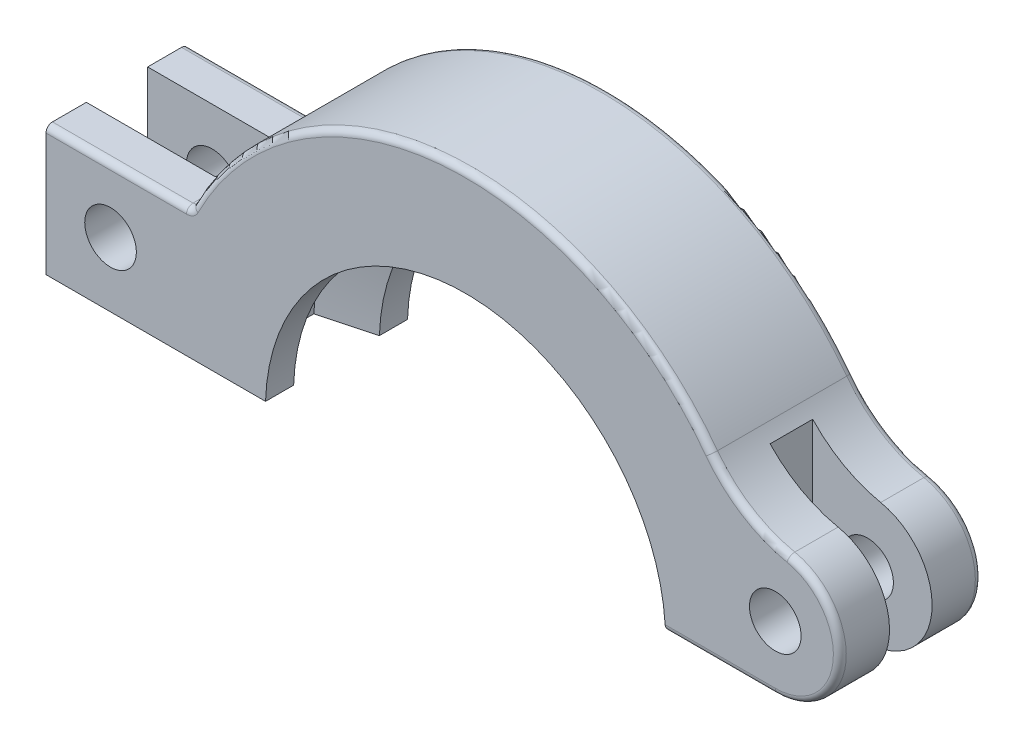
ISO-10303-21;
HEADER;
FILE_DESCRIPTION(('STEP AP214'),'2;1');
FILE_NAME('part.step','',(''),(''),'','','');
FILE_SCHEMA(('AUTOMOTIVE_DESIGN { 1 0 10303 214 1 1 1 1 }'));
ENDSEC;
DATA;
#1=APPLICATION_CONTEXT('core data for automotive mechanical design processes');
#2=APPLICATION_PROTOCOL_DEFINITION('international standard','automotive_design',2000,#1);
#3=PRODUCT_CONTEXT('',#1,'mechanical');
#4=PRODUCT('Part','Part','',(#3));
#5=PRODUCT_RELATED_PRODUCT_CATEGORY('part','',(#4));
#6=PRODUCT_DEFINITION_FORMATION('','',#4);
#7=PRODUCT_DEFINITION_CONTEXT('part definition',#1,'design');
#8=PRODUCT_DEFINITION('design','',#6,#7);
#9=PRODUCT_DEFINITION_SHAPE('','',#8);
#10=(LENGTH_UNIT() NAMED_UNIT(*) SI_UNIT(.MILLI.,.METRE.));
#11=(NAMED_UNIT(*) PLANE_ANGLE_UNIT() SI_UNIT($,.RADIAN.));
#12=(NAMED_UNIT(*) SI_UNIT($,.STERADIAN.) SOLID_ANGLE_UNIT());
#13=UNCERTAINTY_MEASURE_WITH_UNIT(LENGTH_MEASURE(1.E-05),#10,'distance_accuracy_value','');
#14=(GEOMETRIC_REPRESENTATION_CONTEXT(3) GLOBAL_UNCERTAINTY_ASSIGNED_CONTEXT((#13)) GLOBAL_UNIT_ASSIGNED_CONTEXT((#10,
#11,#12)) REPRESENTATION_CONTEXT('',''));
#15=CARTESIAN_POINT('',(0.,0.,0.));
#16=DIRECTION('',(0.,0.,1.));
#17=DIRECTION('',(1.,0.,0.));
#18=AXIS2_PLACEMENT_3D('',#15,#16,#17);
#19=CARTESIAN_POINT('',(30.9838667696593,1.,11.));
#20=DIRECTION('',(0.,1.,0.));
#21=DIRECTION('',(-1.,0.,0.));
#22=AXIS2_PLACEMENT_3D('',#19,#20,#21);
#23=PLANE('',#22);
#24=CARTESIAN_POINT('',(49.0721522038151,1.,1.79844507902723));
#25=CARTESIAN_POINT('',(46.2677102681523,1.,2.54972912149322));
#26=CARTESIAN_POINT('',(43.4632653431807,1.,3.30100201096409));
#27=CARTESIAN_POINT('',(37.854350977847,1.,4.80345618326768));
#28=CARTESIAN_POINT('',(35.0498815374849,1.,5.5546374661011));
#29=CARTESIAN_POINT('',(29.440899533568,1.,7.05683914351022));
#30=CARTESIAN_POINT('',(26.6363869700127,1.,7.80785953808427));
#31=CARTESIAN_POINT('',(22.4295386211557,1.,8.93409324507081));
#32=CARTESIAN_POINT('',(21.0272425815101,0.999999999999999,9.30945500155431));
#33=CARTESIAN_POINT('',(18.2225959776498,0.999999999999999,10.0599747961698));
#34=CARTESIAN_POINT('',(16.8202454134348,0.999999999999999,10.4351328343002));
#35=CARTESIAN_POINT('',(15.4178535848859,0.999999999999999,10.8101366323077));
#36=B_SPLINE_CURVE_WITH_KNOTS('',3,(#24,#25,#26,#27,#28,#29,#30,#31,#32,#33,#34,#35),
.UNSPECIFIED.,.F.,.F.,(4,2,2,2,2,4),(0.,8.70998855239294,17.4199770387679,26.1299656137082,
30.4849599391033,34.8399543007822),.UNSPECIFIED.);
#37=CARTESIAN_POINT('',(38.9871773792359,1.,4.5));
#38=VERTEX_POINT('',#37);
#39=CARTESIAN_POINT('',(30.9838667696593,1.,6.64359353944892));
#40=VERTEX_POINT('',#39);
#41=EDGE_CURVE('E239',#38,#40,#36,.T.);
#42=ORIENTED_EDGE('',*,*,#41,.F.);
#43=DIRECTION('',(0.,0.,1.));
#44=VECTOR('',#43,1.);
#45=CARTESIAN_POINT('',(38.9871773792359,1.,0.));
#46=LINE('',#45,#44);
#47=CARTESIAN_POINT('',(38.9871773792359,1.,-4.5));
#48=VERTEX_POINT('',#47);
#49=EDGE_CURVE('E232',#48,#38,#46,.T.);
#50=ORIENTED_EDGE('',*,*,#49,.F.);
#51=CARTESIAN_POINT('',(14.999598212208,0.999999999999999,-10.921966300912));
#52=CARTESIAN_POINT('',(16.2308050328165,0.999999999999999,-10.5927799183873));
#53=CARTESIAN_POINT('',(17.4619760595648,0.999999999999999,-10.263459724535));
#54=CARTESIAN_POINT('',(19.9242698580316,0.999999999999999,-9.6046390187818));
#55=CARTESIAN_POINT('',(21.1553926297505,1.,-9.27513850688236));
#56=CARTESIAN_POINT('',(24.8487235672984,1.,-8.28649744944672));
#57=CARTESIAN_POINT('',(27.3108943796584,1.,-7.62721737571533));
#58=CARTESIAN_POINT('',(30.4577579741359,1.,-6.78449127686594));
#59=CARTESIAN_POINT('',(31.1424706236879,1.,-6.6011194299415));
#60=CARTESIAN_POINT('',(34.631675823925,1.,-5.66665252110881));
#61=CARTESIAN_POINT('',(37.4361465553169,1.,-4.91547598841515));
#62=CARTESIAN_POINT('',(43.0450626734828,1.,-3.41302835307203));
#63=CARTESIAN_POINT('',(45.8495080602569,1.,-2.66175725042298));
#64=CARTESIAN_POINT('',(48.6539513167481,1.,-1.91047820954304));
#65=B_SPLINE_CURVE_WITH_KNOTS('',3,(#51,#52,#53,#54,#55,#56,#57,#58,#59,#60,#61,#62,#63,#64),
.UNSPECIFIED.,.F.,.F.,(4,2,2,2,2,2,4),(0.,3.82336304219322,7.64672605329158,15.2934520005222,
17.4199772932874,26.1299658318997,34.8399543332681),.UNSPECIFIED.);
#66=CARTESIAN_POINT('',(30.9838667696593,1.,-6.64359353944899));
#67=VERTEX_POINT('',#66);
#68=EDGE_CURVE('E219',#67,#48,#65,.T.);
#69=ORIENTED_EDGE('',*,*,#68,.F.);
#70=DIRECTION('',(0.,0.,-1.));
#71=VECTOR('',#70,1.);
#72=CARTESIAN_POINT('',(30.9838667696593,1.,11.));
#73=LINE('',#72,#71);
#74=CARTESIAN_POINT('',(30.9838667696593,1.,-10.));
#75=VERTEX_POINT('',#74);
#76=EDGE_CURVE('E338',#67,#75,#73,.T.);
#77=ORIENTED_EDGE('',*,*,#76,.T.);
#78=DIRECTION('',(1.,0.,0.));
#79=VECTOR('',#78,1.);
#80=CARTESIAN_POINT('',(30.9838667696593,1.,-10.));
#81=LINE('',#80,#79);
#82=CARTESIAN_POINT('',(48.,1.,-10.));
#83=VERTEX_POINT('',#82);
#84=EDGE_CURVE('E365',#75,#83,#81,.T.);
#85=ORIENTED_EDGE('',*,*,#84,.T.);
#86=DIRECTION('',(0.,0.,-1.));
#87=VECTOR('',#86,1.);
#88=CARTESIAN_POINT('',(48.,1.,11.));
#89=LINE('',#88,#87);
#90=CARTESIAN_POINT('',(48.,0.999999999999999,-3.30000000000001));
#91=VERTEX_POINT('',#90);
#92=EDGE_CURVE('E335',#91,#83,#89,.T.);
#93=ORIENTED_EDGE('',*,*,#92,.F.);
#94=DIRECTION('',(1.,0.,0.));
#95=VECTOR('',#94,1.);
#96=CARTESIAN_POINT('',(30.9838667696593,1.,-3.3));
#97=LINE('',#96,#95);
#98=CARTESIAN_POINT('',(39.5,1.,-3.30000000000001));
#99=VERTEX_POINT('',#98);
#100=EDGE_CURVE('E273',#99,#91,#97,.T.);
#101=ORIENTED_EDGE('',*,*,#100,.F.);
#102=DIRECTION('',(0.,0.,-1.));
#103=VECTOR('',#102,1.);
#104=CARTESIAN_POINT('',(39.5,1.,11.));
#105=LINE('',#104,#103);
#106=CARTESIAN_POINT('',(39.5,1.,3.29999999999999));
#107=VERTEX_POINT('',#106);
#108=EDGE_CURVE('E275',#107,#99,#105,.T.);
#109=ORIENTED_EDGE('',*,*,#108,.F.);
#110=DIRECTION('',(-1.,0.,0.));
#111=VECTOR('',#110,1.);
#112=CARTESIAN_POINT('',(30.9838667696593,1.,3.3));
#113=LINE('',#112,#111);
#114=CARTESIAN_POINT('',(48.,0.999999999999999,3.29999999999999));
#115=VERTEX_POINT('',#114);
#116=EDGE_CURVE('E266',#115,#107,#113,.T.);
#117=ORIENTED_EDGE('',*,*,#116,.F.);
#118=CARTESIAN_POINT('',(48.,1.,10.));
#119=VERTEX_POINT('',#118);
#120=EDGE_CURVE('E336',#119,#115,#89,.T.);
#121=ORIENTED_EDGE('',*,*,#120,.F.);
#122=DIRECTION('',(1.,0.,0.));
#123=VECTOR('',#122,1.);
#124=CARTESIAN_POINT('',(30.9838667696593,1.,10.));
#125=LINE('',#124,#123);
#126=CARTESIAN_POINT('',(30.9838667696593,1.,10.));
#127=VERTEX_POINT('',#126);
#128=EDGE_CURVE('E363',#119,#127,#125,.F.);
#129=ORIENTED_EDGE('',*,*,#128,.T.);
#130=EDGE_CURVE('E339',#127,#40,#73,.T.);
#131=ORIENTED_EDGE('',*,*,#130,.T.);
#132=EDGE_LOOP('',(#42,#50,#69,#77,#85,#93,#101,#109,#117,#121,#129,#131));
#133=FACE_BOUND('',#132,.T.);
#134=ADVANCED_FACE('F34',(#133),#23,.F.);
#135=CARTESIAN_POINT('',(-65.,1.,11.));
#136=DIRECTION('',(0.,1.,0.));
#137=DIRECTION('',(0.,0.,1.));
#138=AXIS2_PLACEMENT_3D('',#135,#136,#137);
#139=PLANE('',#138);
#140=CARTESIAN_POINT('',(-21.027961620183,1.,9.30922550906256));
#141=CARTESIAN_POINT('',(-23.8325618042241,1.,8.55853239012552));
#142=CARTESIAN_POINT('',(-26.6371071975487,1.,7.80763464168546));
#143=CARTESIAN_POINT('',(-32.2461307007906,1.,6.3055879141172));
#144=CARTESIAN_POINT('',(-35.0506088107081,1.,5.55443893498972));
#145=CARTESIAN_POINT('',(-40.6595400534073,1.,4.05204777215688));
#146=CARTESIAN_POINT('',(-43.4639931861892,1.,3.30080558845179));
#147=CARTESIAN_POINT('',(-49.0728829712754,1.,1.79825967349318));
#148=CARTESIAN_POINT('',(-51.8773196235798,1.,1.04695594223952));
#149=CARTESIAN_POINT('',(-54.6817522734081,1.,0.29563726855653));
#150=B_SPLINE_CURVE_WITH_KNOTS('',3,(#140,#141,#142,#143,#144,#145,#146,#147,#148,#149),
.UNSPECIFIED.,.F.,.F.,(4,2,2,2,4),(0.,8.70998855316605,17.4199770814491,26.1299655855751,
34.839954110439),.UNSPECIFIED.);
#151=CARTESIAN_POINT('',(-30.9838667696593,1.,6.64359353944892));
#152=VERTEX_POINT('',#151);
#153=CARTESIAN_POINT('',(-38.9871773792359,1.,4.5));
#154=VERTEX_POINT('',#153);
#155=EDGE_CURVE('E227',#152,#154,#150,.T.);
#156=ORIENTED_EDGE('',*,*,#155,.F.);
#157=DIRECTION('',(0.,0.,-1.));
#158=VECTOR('',#157,1.);
#159=CARTESIAN_POINT('',(-30.9838667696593,1.,11.));
#160=LINE('',#159,#158);
#161=CARTESIAN_POINT('',(-30.9838667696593,1.,11.));
#162=VERTEX_POINT('',#161);
#163=EDGE_CURVE('E342',#162,#152,#160,.T.);
#164=ORIENTED_EDGE('',*,*,#163,.F.);
#165=DIRECTION('',(1.,0.,0.));
#166=VECTOR('',#165,1.);
#167=CARTESIAN_POINT('',(-65.,1.,11.));
#168=LINE('',#167,#166);
#169=CARTESIAN_POINT('',(-65.,1.,11.));
#170=VERTEX_POINT('',#169);
#171=EDGE_CURVE('E315',#170,#162,#168,.T.);
#172=ORIENTED_EDGE('',*,*,#171,.F.);
#173=DIRECTION('',(0.,0.,-1.));
#174=VECTOR('',#173,1.);
#175=CARTESIAN_POINT('',(-65.,1.,11.));
#176=LINE('',#175,#174);
#177=CARTESIAN_POINT('',(-65.,1.,4.75));
#178=VERTEX_POINT('',#177);
#179=EDGE_CURVE('E346',#170,#178,#176,.T.);
#180=ORIENTED_EDGE('',*,*,#179,.T.);
#181=DIRECTION('',(-1.,0.,0.));
#182=VECTOR('',#181,1.);
#183=CARTESIAN_POINT('',(-65.,1.,4.75));
#184=LINE('',#183,#182);
#185=CARTESIAN_POINT('',(-45.,1.,4.75));
#186=VERTEX_POINT('',#185);
#187=EDGE_CURVE('E296',#186,#178,#184,.T.);
#188=ORIENTED_EDGE('',*,*,#187,.F.);
#189=DIRECTION('',(0.,0.,1.));
#190=VECTOR('',#189,1.);
#191=CARTESIAN_POINT('',(-45.,1.,11.));
#192=LINE('',#191,#190);
#193=CARTESIAN_POINT('',(-45.,1.,-4.75));
#194=VERTEX_POINT('',#193);
#195=EDGE_CURVE('E298',#194,#186,#192,.T.);
#196=ORIENTED_EDGE('',*,*,#195,.F.);
#197=DIRECTION('',(1.,0.,0.));
#198=VECTOR('',#197,1.);
#199=CARTESIAN_POINT('',(-65.,1.,-4.75));
#200=LINE('',#199,#198);
#201=CARTESIAN_POINT('',(-65.,1.,-4.75));
#202=VERTEX_POINT('',#201);
#203=EDGE_CURVE('E288',#202,#194,#200,.T.);
#204=ORIENTED_EDGE('',*,*,#203,.F.);
#205=CARTESIAN_POINT('',(-65.,1.,-11.));
#206=VERTEX_POINT('',#205);
#207=EDGE_CURVE('E345',#202,#206,#176,.T.);
#208=ORIENTED_EDGE('',*,*,#207,.T.);
#209=DIRECTION('',(1.,0.,0.));
#210=VECTOR('',#209,1.);
#211=CARTESIAN_POINT('',(-65.,1.,-11.));
#212=LINE('',#211,#210);
#213=CARTESIAN_POINT('',(-30.9838667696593,1.,-11.));
#214=VERTEX_POINT('',#213);
#215=EDGE_CURVE('E323',#206,#214,#212,.T.);
#216=ORIENTED_EDGE('',*,*,#215,.T.);
#217=CARTESIAN_POINT('',(-30.9838667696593,1.,-6.64359353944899));
#218=VERTEX_POINT('',#217);
#219=EDGE_CURVE('E341',#218,#214,#160,.T.);
#220=ORIENTED_EDGE('',*,*,#219,.F.);
#221=CARTESIAN_POINT('',(-54.6817522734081,1.,-0.295637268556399));
#222=CARTESIAN_POINT('',(-51.8773196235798,1.,-1.04695594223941));
#223=CARTESIAN_POINT('',(-49.0728829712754,1.,-1.7982596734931));
#224=CARTESIAN_POINT('',(-43.4639931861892,1.,-3.30080558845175));
#225=CARTESIAN_POINT('',(-40.6595400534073,1.,-4.05204777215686));
#226=CARTESIAN_POINT('',(-35.0506088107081,1.,-5.55443893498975));
#227=CARTESIAN_POINT('',(-32.2461307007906,1.,-6.30558791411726));
#228=CARTESIAN_POINT('',(-26.6371071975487,1.,-7.80763464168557));
#229=CARTESIAN_POINT('',(-23.8325618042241,1.,-8.55853239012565));
#230=CARTESIAN_POINT('',(-21.027961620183,1.,-9.30922550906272));
#231=B_SPLINE_CURVE_WITH_KNOTS('',3,(#221,#222,#223,#224,#225,#226,#227,#228,#229,#230),
.UNSPECIFIED.,.F.,.F.,(4,2,2,2,4),(0.,8.70998852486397,17.41997702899,26.129965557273,
34.8399541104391),.UNSPECIFIED.);
#232=CARTESIAN_POINT('',(-38.9871773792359,1.,-4.5));
#233=VERTEX_POINT('',#232);
#234=EDGE_CURVE('E50',#233,#218,#231,.T.);
#235=ORIENTED_EDGE('',*,*,#234,.F.);
#236=DIRECTION('',(0.,0.,1.));
#237=VECTOR('',#236,1.);
#238=CARTESIAN_POINT('',(-38.9871773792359,1.,0.));
#239=LINE('',#238,#237);
#240=EDGE_CURVE('E11',#154,#233,#239,.F.);
#241=ORIENTED_EDGE('',*,*,#240,.F.);
#242=EDGE_LOOP('',(#156,#164,#172,#180,#188,#196,#204,#208,#216,#220,#235,#241));
#243=FACE_BOUND('',#242,.T.);
#244=ADVANCED_FACE('F398',(#243),#139,.F.);
#245=CARTESIAN_POINT('',(0.,0.,11.));
#246=DIRECTION('',(0.,0.,-1.));
#247=DIRECTION('',(-1.,0.,0.));
#248=AXIS2_PLACEMENT_3D('',#245,#246,#247);
#249=CYLINDRICAL_SURFACE('',#248,31.);
#250=CARTESIAN_POINT('',(0.,0.,6.64359353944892));
#251=DIRECTION('',(0.,0.,-1.));
#252=DIRECTION('',(-1.,0.,0.));
#253=AXIS2_PLACEMENT_3D('',#250,#251,#252);
#254=CIRCLE('',#253,31.);
#255=EDGE_CURVE('E43',#40,#152,#254,.F.);
#256=ORIENTED_EDGE('',*,*,#255,.F.);
#257=ORIENTED_EDGE('',*,*,#130,.F.);
#258=CARTESIAN_POINT('',(30.9838667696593,1.,10.));
#259=CARTESIAN_POINT('',(30.9838665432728,1.00000018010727,10.0281206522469));
#260=CARTESIAN_POINT('',(30.9838284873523,1.00118690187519,10.0562278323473));
#261=CARTESIAN_POINT('',(30.9836752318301,1.00592117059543,10.1122410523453));
#262=CARTESIAN_POINT('',(30.983560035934,1.00946860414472,10.1401471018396));
#263=CARTESIAN_POINT('',(30.9830970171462,1.02361814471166,10.2232146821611));
#264=CARTESIAN_POINT('',(30.9826317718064,1.03772758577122,10.2778197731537));
#265=CARTESIAN_POINT('',(30.9813640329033,1.07490676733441,10.3838832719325));
#266=CARTESIAN_POINT('',(30.9805613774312,1.09798080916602,10.43534015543));
#267=CARTESIAN_POINT('',(30.9785836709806,1.15242913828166,10.5336462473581));
#268=CARTESIAN_POINT('',(30.9774086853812,1.18380196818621,10.5804962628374));
#269=CARTESIAN_POINT('',(30.9746480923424,1.2539554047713,10.6682623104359));
#270=CARTESIAN_POINT('',(30.9730624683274,1.29273631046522,10.7091781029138));
#271=CARTESIAN_POINT('',(30.9694479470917,1.37660882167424,10.7839252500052));
#272=CARTESIAN_POINT('',(30.9674189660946,1.4217016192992,10.8177552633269));
#273=CARTESIAN_POINT('',(30.9629003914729,1.51692803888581,10.8773827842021));
#274=CARTESIAN_POINT('',(30.9604105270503,1.56706461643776,10.9031755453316));
#275=CARTESIAN_POINT('',(30.9549788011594,1.67092308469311,10.9459694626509));
#276=CARTESIAN_POINT('',(30.9520371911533,1.72464297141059,10.962975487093));
#277=CARTESIAN_POINT('',(30.9468095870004,1.81557006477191,10.9835479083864));
#278=CARTESIAN_POINT('',(30.9446383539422,1.85221695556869,10.9897144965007));
#279=CARTESIAN_POINT('',(30.9401399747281,1.92590574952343,10.9979400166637));
#280=CARTESIAN_POINT('',(30.9378130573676,1.96294700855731,11.000004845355));
#281=CARTESIAN_POINT('',(30.935416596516,2.,11.));
#282=B_SPLINE_CURVE_WITH_KNOTS('',3,(#258,#259,#260,#261,#262,#263,#264,#265,#266,#267,#268,
#269,#270,#271,#272,#273,#274,#275,#276,#277,#278,#279,#280,#281),.UNSPECIFIED.,.F.,.F.,(4,2,2,
2,2,2,2,2,2,2,2,4),(0.,0.0843101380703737,0.168616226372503,0.336949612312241,0.505363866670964,
0.673748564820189,0.842140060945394,1.0105634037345,1.17908602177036,1.3475151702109,
1.45897763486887,1.57027974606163),.UNSPECIFIED.);
#283=CARTESIAN_POINT('',(30.935416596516,2.,11.));
#284=VERTEX_POINT('',#283);
#285=EDGE_CURVE('E381',#127,#284,#282,.T.);
#286=ORIENTED_EDGE('',*,*,#285,.T.);
#287=CARTESIAN_POINT('',(0.,0.,11.));
#288=DIRECTION('',(0.,0.,-1.));
#289=DIRECTION('',(1.,0.,0.));
#290=AXIS2_PLACEMENT_3D('',#287,#288,#289);
#291=CIRCLE('',#290,31.);
#292=EDGE_CURVE('E318',#162,#284,#291,.T.);
#293=ORIENTED_EDGE('',*,*,#292,.F.);
#294=ORIENTED_EDGE('',*,*,#163,.T.);
#295=EDGE_LOOP('',(#256,#257,#286,#293,#294));
#296=FACE_BOUND('',#295,.T.);
#297=ADVANCED_FACE('F393',(#296),#249,.F.);
#298=CARTESIAN_POINT('',(0.,0.,-6.64359353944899));
#299=DIRECTION('',(0.,0.,1.));
#300=DIRECTION('',(1.,0.,0.));
#301=AXIS2_PLACEMENT_3D('',#298,#299,#300);
#302=CIRCLE('',#301,31.);
#303=EDGE_CURVE('E223',#218,#67,#302,.F.);
#304=ORIENTED_EDGE('',*,*,#303,.F.);
#305=ORIENTED_EDGE('',*,*,#219,.T.);
#306=CARTESIAN_POINT('',(0.,0.,-11.));
#307=DIRECTION('',(0.,0.,-1.));
#308=DIRECTION('',(1.,0.,0.));
#309=AXIS2_PLACEMENT_3D('',#306,#307,#308);
#310=CIRCLE('',#309,31.);
#311=CARTESIAN_POINT('',(30.935416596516,2.,-11.));
#312=VERTEX_POINT('',#311);
#313=EDGE_CURVE('E316',#214,#312,#310,.T.);
#314=ORIENTED_EDGE('',*,*,#313,.T.);
#315=CARTESIAN_POINT('',(30.935416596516,2.,-11.));
#316=CARTESIAN_POINT('',(30.9372355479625,1.97186831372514,-10.9999997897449));
#317=CARTESIAN_POINT('',(30.9390147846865,1.94374748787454,-10.9988121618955));
#318=CARTESIAN_POINT('',(30.942484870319,1.88770138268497,-10.9940728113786));
#319=CARTESIAN_POINT('',(30.9441757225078,1.85977609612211,-10.9905211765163));
#320=CARTESIAN_POINT('',(30.9490972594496,1.77663904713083,-10.9763512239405));
#321=CARTESIAN_POINT('',(30.9521827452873,1.7219758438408,-10.9622177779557));
#322=CARTESIAN_POINT('',(30.9579084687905,1.61577877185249,-10.9249576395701));
#323=CARTESIAN_POINT('',(30.9605484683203,1.5642465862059,-10.9018261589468));
#324=CARTESIAN_POINT('',(30.9653659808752,1.46578965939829,-10.8472222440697));
#325=CARTESIAN_POINT('',(30.9675435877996,1.41886398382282,-10.8157515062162));
#326=CARTESIAN_POINT('',(30.971443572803,1.33102137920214,-10.7454062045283));
#327=CARTESIAN_POINT('',(30.9731665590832,1.29009645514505,-10.7065416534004));
#328=CARTESIAN_POINT('',(30.9761900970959,1.21533961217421,-10.6224725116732));
#329=CARTESIAN_POINT('',(30.9774905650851,1.18150909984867,-10.5772666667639));
#330=CARTESIAN_POINT('',(30.9797051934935,1.12194346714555,-10.4818493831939));
#331=CARTESIAN_POINT('',(30.9806196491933,1.09620216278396,-10.4316418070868));
#332=CARTESIAN_POINT('',(30.9821004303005,1.05352349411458,-10.3276241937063));
#333=CARTESIAN_POINT('',(30.982666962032,1.03658091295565,-10.2738163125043));
#334=CARTESIAN_POINT('',(30.9833404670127,1.01620782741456,-10.1830639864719));
#335=CARTESIAN_POINT('',(30.9835385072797,1.01013355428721,-10.146691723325));
#336=CARTESIAN_POINT('',(30.9838012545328,1.00203019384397,-10.0735514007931));
#337=CARTESIAN_POINT('',(30.983866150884,0.999995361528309,-10.0367839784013));
#338=CARTESIAN_POINT('',(30.9838667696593,1.,-10.));
#339=B_SPLINE_CURVE_WITH_KNOTS('',3,(#315,#316,#317,#318,#319,#320,#321,#322,#323,#324,#325,
#326,#327,#328,#329,#330,#331,#332,#333,#334,#335,#336,#337,#338),.UNSPECIFIED.,.F.,.F.,(4,2,2,
2,2,2,2,2,2,2,2,4),(0.,0.0845195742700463,0.16903600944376,0.337801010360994,0.506655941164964,
0.675476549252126,0.844070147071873,1.01269713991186,1.18119490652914,1.34959265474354,
1.46001320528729,1.5702765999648),.UNSPECIFIED.);
#340=EDGE_CURVE('E387',#312,#75,#339,.T.);
#341=ORIENTED_EDGE('',*,*,#340,.T.);
#342=ORIENTED_EDGE('',*,*,#76,.F.);
#343=EDGE_LOOP('',(#304,#305,#314,#341,#342));
#344=FACE_BOUND('',#343,.T.);
#345=ADVANCED_FACE('F397',(#344),#249,.F.);
#346=CARTESIAN_POINT('',(48.,11.,11.));
#347=DIRECTION('',(0.,0.,-1.));
#348=DIRECTION('',(-1.,0.,0.));
#349=AXIS2_PLACEMENT_3D('',#346,#347,#348);
#350=CYLINDRICAL_SURFACE('',#349,10.);
#351=ORIENTED_EDGE('',*,*,#92,.T.);
#352=CARTESIAN_POINT('',(48.,11.,-10.));
#353=DIRECTION('',(0.,0.,1.));
#354=DIRECTION('',(1.,0.,0.));
#355=AXIS2_PLACEMENT_3D('',#352,#353,#354);
#356=CIRCLE('',#355,10.);
#357=CARTESIAN_POINT('',(50.0312833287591,20.7915212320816,-10.));
#358=VERTEX_POINT('',#357);
#359=EDGE_CURVE('E804',#83,#358,#356,.T.);
#360=ORIENTED_EDGE('',*,*,#359,.T.);
#361=DIRECTION('',(0.,0.,-1.));
#362=VECTOR('',#361,1.);
#363=CARTESIAN_POINT('',(50.0312833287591,20.7915212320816,11.));
#364=LINE('',#363,#362);
#365=CARTESIAN_POINT('',(50.0312833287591,20.7915212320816,-3.30000000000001));
#366=VERTEX_POINT('',#365);
#367=EDGE_CURVE('E332',#366,#358,#364,.T.);
#368=ORIENTED_EDGE('',*,*,#367,.F.);
#369=CARTESIAN_POINT('',(48.,11.,-3.30000000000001));
#370=DIRECTION('',(0.,0.,1.));
#371=DIRECTION('',(1.,0.,0.));
#372=AXIS2_PLACEMENT_3D('',#369,#370,#371);
#373=CIRCLE('',#372,10.);
#374=EDGE_CURVE('E271',#91,#366,#373,.T.);
#375=ORIENTED_EDGE('',*,*,#374,.F.);
#376=EDGE_LOOP('',(#351,#360,#368,#375));
#377=FACE_BOUND('',#376,.T.);
#378=ADVANCED_FACE('F482',(#377),#350,.T.);
#379=CARTESIAN_POINT('',(50.0312833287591,20.7915212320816,10.));
#380=VERTEX_POINT('',#379);
#381=CARTESIAN_POINT('',(50.0312833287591,20.7915212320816,3.29999999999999));
#382=VERTEX_POINT('',#381);
#383=EDGE_CURVE('E333',#380,#382,#364,.T.);
#384=ORIENTED_EDGE('',*,*,#383,.F.);
#385=CARTESIAN_POINT('',(48.,11.,10.));
#386=DIRECTION('',(0.,0.,1.));
#387=DIRECTION('',(1.,0.,0.));
#388=AXIS2_PLACEMENT_3D('',#385,#386,#387);
#389=CIRCLE('',#388,10.);
#390=EDGE_CURVE('E863',#380,#119,#389,.F.);
#391=ORIENTED_EDGE('',*,*,#390,.T.);
#392=ORIENTED_EDGE('',*,*,#120,.T.);
#393=CARTESIAN_POINT('',(48.,11.,3.29999999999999));
#394=DIRECTION('',(0.,0.,-1.));
#395=DIRECTION('',(-1.,0.,0.));
#396=AXIS2_PLACEMENT_3D('',#393,#394,#395);
#397=CIRCLE('',#396,10.);
#398=EDGE_CURVE('E263',#382,#115,#397,.T.);
#399=ORIENTED_EDGE('',*,*,#398,.F.);
#400=EDGE_LOOP('',(#384,#391,#392,#399));
#401=FACE_BOUND('',#400,.T.);
#402=ADVANCED_FACE('F480',(#401),#350,.T.);
#403=CARTESIAN_POINT('',(54.0938499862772,40.3745636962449,11.));
#404=DIRECTION('',(0.,0.,-1.));
#405=DIRECTION('',(-1.,0.,0.));
#406=AXIS2_PLACEMENT_3D('',#403,#404,#405);
#407=CYLINDRICAL_SURFACE('',#406,20.);
#408=ORIENTED_EDGE('',*,*,#367,.T.);
#409=CARTESIAN_POINT('',(54.0938499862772,40.3745636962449,-10.));
#410=DIRECTION('',(0.,0.,1.));
#411=DIRECTION('',(1.,0.,0.));
#412=AXIS2_PLACEMENT_3D('',#409,#410,#411);
#413=CIRCLE('',#412,20.);
#414=CARTESIAN_POINT('',(38.0660425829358,28.4117300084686,-10.));
#415=VERTEX_POINT('',#414);
#416=EDGE_CURVE('E807',#358,#415,#413,.F.);
#417=ORIENTED_EDGE('',*,*,#416,.T.);
#418=DIRECTION('',(0.,0.,-1.));
#419=VECTOR('',#418,1.);
#420=CARTESIAN_POINT('',(38.0660425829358,28.4117300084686,11.));
#421=LINE('',#420,#419);
#422=CARTESIAN_POINT('',(38.0660425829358,28.4117300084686,10.));
#423=VERTEX_POINT('',#422);
#424=EDGE_CURVE('E330',#423,#415,#421,.T.);
#425=ORIENTED_EDGE('',*,*,#424,.F.);
#426=CARTESIAN_POINT('',(54.0938499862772,40.3745636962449,10.));
#427=DIRECTION('',(0.,0.,1.));
#428=DIRECTION('',(1.,0.,0.));
#429=AXIS2_PLACEMENT_3D('',#426,#427,#428);
#430=CIRCLE('',#429,20.);
#431=EDGE_CURVE('E816',#423,#380,#430,.T.);
#432=ORIENTED_EDGE('',*,*,#431,.T.);
#433=ORIENTED_EDGE('',*,*,#383,.T.);
#434=CARTESIAN_POINT('',(54.0938499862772,40.3745636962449,3.29999999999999));
#435=DIRECTION('',(0.,0.,-1.));
#436=DIRECTION('',(-1.,0.,0.));
#437=AXIS2_PLACEMENT_3D('',#434,#435,#436);
#438=CIRCLE('',#437,20.);
#439=CARTESIAN_POINT('',(39.5,26.6990548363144,3.29999999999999));
#440=VERTEX_POINT('',#439);
#441=EDGE_CURVE('E260',#440,#382,#438,.F.);
#442=ORIENTED_EDGE('',*,*,#441,.F.);
#443=DIRECTION('',(0.,0.,-1.));
#444=VECTOR('',#443,1.);
#445=CARTESIAN_POINT('',(39.5,26.6990548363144,11.));
#446=LINE('',#445,#444);
#447=CARTESIAN_POINT('',(39.5,26.6990548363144,-3.30000000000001));
#448=VERTEX_POINT('',#447);
#449=EDGE_CURVE('E356',#448,#440,#446,.F.);
#450=ORIENTED_EDGE('',*,*,#449,.F.);
#451=CARTESIAN_POINT('',(54.0938499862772,40.3745636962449,-3.30000000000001));
#452=DIRECTION('',(0.,0.,1.));
#453=DIRECTION('',(1.,0.,0.));
#454=AXIS2_PLACEMENT_3D('',#451,#452,#453);
#455=CIRCLE('',#454,20.);
#456=EDGE_CURVE('E269',#366,#448,#455,.F.);
#457=ORIENTED_EDGE('',*,*,#456,.F.);
#458=EDGE_LOOP('',(#408,#417,#425,#432,#433,#442,#450,#457));
#459=FACE_BOUND('',#458,.T.);
#460=ADVANCED_FACE('F457',(#459),#407,.F.);
#461=CARTESIAN_POINT('',(48.,11.,11.));
#462=DIRECTION('',(0.,0.,-1.));
#463=DIRECTION('',(-1.,0.,0.));
#464=AXIS2_PLACEMENT_3D('',#461,#462,#463);
#465=CYLINDRICAL_SURFACE('',#464,4.00000000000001);
#466=CARTESIAN_POINT('',(48.,11.,-11.));
#467=DIRECTION('',(0.,0.,1.));
#468=DIRECTION('',(1.,0.,0.));
#469=AXIS2_PLACEMENT_3D('',#466,#467,#468);
#470=CIRCLE('',#469,4.00000000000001);
#471=CARTESIAN_POINT('',(52.,11.,-11.));
#472=VERTEX_POINT('',#471);
#473=EDGE_CURVE('E300',#472,#472,#470,.T.);
#474=ORIENTED_EDGE('',*,*,#473,.F.);
#475=EDGE_LOOP('',(#474));
#476=FACE_BOUND('',#475,.T.);
#477=CARTESIAN_POINT('',(48.,11.,-3.30000000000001));
#478=DIRECTION('',(0.,0.,1.));
#479=DIRECTION('',(1.,0.,0.));
#480=AXIS2_PLACEMENT_3D('',#477,#478,#479);
#481=CIRCLE('',#480,4.00000000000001);
#482=CARTESIAN_POINT('',(52.,11.,-3.30000000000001));
#483=VERTEX_POINT('',#482);
#484=EDGE_CURVE('E268',#483,#483,#481,.T.);
#485=ORIENTED_EDGE('',*,*,#484,.T.);
#486=EDGE_LOOP('',(#485));
#487=FACE_BOUND('',#486,.T.);
#488=ADVANCED_FACE('F453',(#476,#487),#465,.F.);
#489=CARTESIAN_POINT('',(48.,11.,11.));
#490=DIRECTION('',(0.,0.,1.));
#491=DIRECTION('',(1.,0.,0.));
#492=AXIS2_PLACEMENT_3D('',#489,#490,#491);
#493=CIRCLE('',#492,4.00000000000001);
#494=CARTESIAN_POINT('',(52.,11.,11.));
#495=VERTEX_POINT('',#494);
#496=EDGE_CURVE('E301',#495,#495,#493,.T.);
#497=ORIENTED_EDGE('',*,*,#496,.T.);
#498=EDGE_LOOP('',(#497));
#499=FACE_BOUND('',#498,.T.);
#500=CARTESIAN_POINT('',(48.,11.,3.29999999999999));
#501=DIRECTION('',(0.,0.,-1.));
#502=DIRECTION('',(-1.,0.,0.));
#503=AXIS2_PLACEMENT_3D('',#500,#501,#502);
#504=CIRCLE('',#503,4.00000000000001);
#505=CARTESIAN_POINT('',(44.,11.,3.29999999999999));
#506=VERTEX_POINT('',#505);
#507=EDGE_CURVE('E259',#506,#506,#504,.T.);
#508=ORIENTED_EDGE('',*,*,#507,.T.);
#509=EDGE_LOOP('',(#508));
#510=FACE_BOUND('',#509,.T.);
#511=ADVANCED_FACE('F456',(#499,#510),#465,.F.);
#512=CARTESIAN_POINT('',(-65.,1.,11.));
#513=DIRECTION('',(1.,0.,0.));
#514=DIRECTION('',(0.,0.,-1.));
#515=AXIS2_PLACEMENT_3D('',#512,#513,#514);
#516=PLANE('',#515);
#517=DIRECTION('',(0.,-1.,0.));
#518=VECTOR('',#517,1.);
#519=CARTESIAN_POINT('',(-65.,1.,11.));
#520=LINE('',#519,#518);
#521=CARTESIAN_POINT('',(-65.,20.,11.));
#522=VERTEX_POINT('',#521);
#523=EDGE_CURVE('E313',#522,#170,#520,.T.);
#524=ORIENTED_EDGE('',*,*,#523,.F.);
#525=CARTESIAN_POINT('',(-65.,20.,10.));
#526=DIRECTION('',(1.,0.,0.));
#527=DIRECTION('',(0.,0.,-1.));
#528=AXIS2_PLACEMENT_3D('',#525,#526,#527);
#529=CIRCLE('',#528,1.);
#530=CARTESIAN_POINT('',(-65.,21.,10.));
#531=VERTEX_POINT('',#530);
#532=EDGE_CURVE('E849',#522,#531,#529,.F.);
#533=ORIENTED_EDGE('',*,*,#532,.T.);
#534=DIRECTION('',(0.,0.,-1.));
#535=VECTOR('',#534,1.);
#536=CARTESIAN_POINT('',(-65.,21.,11.));
#537=LINE('',#536,#535);
#538=CARTESIAN_POINT('',(-65.,21.,4.75));
#539=VERTEX_POINT('',#538);
#540=EDGE_CURVE('E328',#531,#539,#537,.T.);
#541=ORIENTED_EDGE('',*,*,#540,.T.);
#542=DIRECTION('',(0.,1.,0.));
#543=VECTOR('',#542,1.);
#544=CARTESIAN_POINT('',(-65.,1.,4.75));
#545=LINE('',#544,#543);
#546=EDGE_CURVE('E293',#178,#539,#545,.T.);
#547=ORIENTED_EDGE('',*,*,#546,.F.);
#548=ORIENTED_EDGE('',*,*,#179,.F.);
#549=EDGE_LOOP('',(#524,#533,#541,#547,#548));
#550=FACE_BOUND('',#549,.T.);
#551=ADVANCED_FACE('F407',(#550),#516,.F.);
#552=CARTESIAN_POINT('',(-65.,21.,-4.75));
#553=VERTEX_POINT('',#552);
#554=CARTESIAN_POINT('',(-65.,21.,-10.));
#555=VERTEX_POINT('',#554);
#556=EDGE_CURVE('E321',#553,#555,#537,.T.);
#557=ORIENTED_EDGE('',*,*,#556,.T.);
#558=CARTESIAN_POINT('',(-65.,20.,-10.));
#559=DIRECTION('',(1.,0.,0.));
#560=DIRECTION('',(0.,0.,-1.));
#561=AXIS2_PLACEMENT_3D('',#558,#559,#560);
#562=CIRCLE('',#561,1.);
#563=CARTESIAN_POINT('',(-65.,20.,-11.));
#564=VERTEX_POINT('',#563);
#565=EDGE_CURVE('E877',#555,#564,#562,.F.);
#566=ORIENTED_EDGE('',*,*,#565,.T.);
#567=DIRECTION('',(0.,-1.,0.));
#568=VECTOR('',#567,1.);
#569=CARTESIAN_POINT('',(-65.,1.,-11.));
#570=LINE('',#569,#568);
#571=EDGE_CURVE('E310',#564,#206,#570,.T.);
#572=ORIENTED_EDGE('',*,*,#571,.T.);
#573=ORIENTED_EDGE('',*,*,#207,.F.);
#574=DIRECTION('',(0.,-1.,0.));
#575=VECTOR('',#574,1.);
#576=CARTESIAN_POINT('',(-65.,1.,-4.75));
#577=LINE('',#576,#575);
#578=EDGE_CURVE('E286',#553,#202,#577,.T.);
#579=ORIENTED_EDGE('',*,*,#578,.F.);
#580=EDGE_LOOP('',(#557,#566,#572,#573,#579));
#581=FACE_BOUND('',#580,.T.);
#582=ADVANCED_FACE('F475',(#581),#516,.F.);
#583=CARTESIAN_POINT('',(-65.,21.,11.));
#584=DIRECTION('',(0.,-1.,0.));
#585=DIRECTION('',(1.,0.,0.));
#586=AXIS2_PLACEMENT_3D('',#583,#584,#585);
#587=PLANE('',#586);
#588=DIRECTION('',(0.,0.,1.));
#589=VECTOR('',#588,1.);
#590=CARTESIAN_POINT('',(-43.2232576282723,21.,-11.));
#591=LINE('',#590,#589);
#592=CARTESIAN_POINT('',(-43.2232576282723,21.,10.));
#593=VERTEX_POINT('',#592);
#594=CARTESIAN_POINT('',(-43.2232576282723,21.,-10.));
#595=VERTEX_POINT('',#594);
#596=EDGE_CURVE('E873',#593,#595,#591,.F.);
#597=ORIENTED_EDGE('',*,*,#596,.T.);
#598=DIRECTION('',(-1.,0.,0.));
#599=VECTOR('',#598,1.);
#600=CARTESIAN_POINT('',(-65.,21.,-10.));
#601=LINE('',#600,#599);
#602=EDGE_CURVE('E875',#595,#555,#601,.T.);
#603=ORIENTED_EDGE('',*,*,#602,.T.);
#604=ORIENTED_EDGE('',*,*,#556,.F.);
#605=DIRECTION('',(-1.,0.,0.));
#606=VECTOR('',#605,1.);
#607=CARTESIAN_POINT('',(-65.,21.,-4.75));
#608=LINE('',#607,#606);
#609=CARTESIAN_POINT('',(-45.,21.,-4.75));
#610=VERTEX_POINT('',#609);
#611=EDGE_CURVE('E284',#610,#553,#608,.T.);
#612=ORIENTED_EDGE('',*,*,#611,.F.);
#613=DIRECTION('',(0.,0.,-1.));
#614=VECTOR('',#613,1.);
#615=CARTESIAN_POINT('',(-45.,21.,11.));
#616=LINE('',#615,#614);
#617=CARTESIAN_POINT('',(-45.,21.,4.75));
#618=VERTEX_POINT('',#617);
#619=EDGE_CURVE('E349',#618,#610,#616,.T.);
#620=ORIENTED_EDGE('',*,*,#619,.F.);
#621=DIRECTION('',(1.,0.,0.));
#622=VECTOR('',#621,1.);
#623=CARTESIAN_POINT('',(-65.,21.,4.75));
#624=LINE('',#623,#622);
#625=EDGE_CURVE('E291',#539,#618,#624,.T.);
#626=ORIENTED_EDGE('',*,*,#625,.F.);
#627=ORIENTED_EDGE('',*,*,#540,.F.);
#628=DIRECTION('',(-1.,0.,0.));
#629=VECTOR('',#628,1.);
#630=CARTESIAN_POINT('',(-42.6057507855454,21.,10.));
#631=LINE('',#630,#629);
#632=EDGE_CURVE('E866',#531,#593,#631,.F.);
#633=ORIENTED_EDGE('',*,*,#632,.T.);
#634=EDGE_LOOP('',(#597,#603,#604,#612,#620,#626,#627,#633));
#635=FACE_BOUND('',#634,.T.);
#636=ADVANCED_FACE('F463',(#635),#587,.F.);
#637=CARTESIAN_POINT('',(-55.,11.,11.));
#638=DIRECTION('',(0.,0.,-1.));
#639=DIRECTION('',(-1.,0.,0.));
#640=AXIS2_PLACEMENT_3D('',#637,#638,#639);
#641=CYLINDRICAL_SURFACE('',#640,4.);
#642=CARTESIAN_POINT('',(-55.,11.,11.));
#643=DIRECTION('',(0.,0.,1.));
#644=DIRECTION('',(1.,0.,0.));
#645=AXIS2_PLACEMENT_3D('',#642,#643,#644);
#646=CIRCLE('',#645,4.);
#647=CARTESIAN_POINT('',(-51.,11.,11.));
#648=VERTEX_POINT('',#647);
#649=EDGE_CURVE('E307',#648,#648,#646,.T.);
#650=ORIENTED_EDGE('',*,*,#649,.T.);
#651=EDGE_LOOP('',(#650));
#652=FACE_BOUND('',#651,.T.);
#653=CARTESIAN_POINT('',(-55.,11.,4.75));
#654=DIRECTION('',(0.,0.,-1.));
#655=DIRECTION('',(-1.,0.,0.));
#656=AXIS2_PLACEMENT_3D('',#653,#654,#655);
#657=CIRCLE('',#656,4.);
#658=CARTESIAN_POINT('',(-59.,11.,4.75));
#659=VERTEX_POINT('',#658);
#660=EDGE_CURVE('E290',#659,#659,#657,.T.);
#661=ORIENTED_EDGE('',*,*,#660,.T.);
#662=EDGE_LOOP('',(#661));
#663=FACE_BOUND('',#662,.T.);
#664=ADVANCED_FACE('F459',(#652,#663),#641,.F.);
#665=CARTESIAN_POINT('',(-55.,11.,-11.));
#666=DIRECTION('',(0.,0.,1.));
#667=DIRECTION('',(1.,0.,0.));
#668=AXIS2_PLACEMENT_3D('',#665,#666,#667);
#669=CIRCLE('',#668,4.);
#670=CARTESIAN_POINT('',(-51.,11.,-11.));
#671=VERTEX_POINT('',#670);
#672=EDGE_CURVE('E304',#671,#671,#669,.T.);
#673=ORIENTED_EDGE('',*,*,#672,.F.);
#674=EDGE_LOOP('',(#673));
#675=FACE_BOUND('',#674,.T.);
#676=CARTESIAN_POINT('',(-55.,11.,-4.75));
#677=DIRECTION('',(0.,0.,1.));
#678=DIRECTION('',(1.,0.,0.));
#679=AXIS2_PLACEMENT_3D('',#676,#677,#678);
#680=CIRCLE('',#679,4.);
#681=CARTESIAN_POINT('',(-51.,11.,-4.75));
#682=VERTEX_POINT('',#681);
#683=EDGE_CURVE('E283',#682,#682,#680,.T.);
#684=ORIENTED_EDGE('',*,*,#683,.T.);
#685=EDGE_LOOP('',(#684));
#686=FACE_BOUND('',#685,.T.);
#687=ADVANCED_FACE('F462',(#675,#686),#641,.F.);
#688=CARTESIAN_POINT('',(0.,0.,11.));
#689=DIRECTION('',(0.,0.,1.));
#690=DIRECTION('',(1.,0.,0.));
#691=AXIS2_PLACEMENT_3D('',#688,#689,#690);
#692=PLANE('',#691);
#693=ORIENTED_EDGE('',*,*,#292,.T.);
#694=DIRECTION('',(1.,0.,0.));
#695=VECTOR('',#694,1.);
#696=CARTESIAN_POINT('',(48.,2.,11.));
#697=LINE('',#696,#695);
#698=CARTESIAN_POINT('',(48.,2.,11.));
#699=VERTEX_POINT('',#698);
#700=EDGE_CURVE('E859',#284,#699,#697,.T.);
#701=ORIENTED_EDGE('',*,*,#700,.T.);
#702=CARTESIAN_POINT('',(48.,11.,11.));
#703=DIRECTION('',(0.,0.,1.));
#704=DIRECTION('',(1.,0.,0.));
#705=AXIS2_PLACEMENT_3D('',#702,#703,#704);
#706=CIRCLE('',#705,9.);
#707=CARTESIAN_POINT('',(49.8281549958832,19.8123691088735,11.));
#708=VERTEX_POINT('',#707);
#709=EDGE_CURVE('E864',#699,#708,#706,.T.);
#710=ORIENTED_EDGE('',*,*,#709,.T.);
#711=CARTESIAN_POINT('',(54.0938499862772,40.3745636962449,11.));
#712=DIRECTION('',(0.,0.,1.));
#713=DIRECTION('',(1.,0.,0.));
#714=AXIS2_PLACEMENT_3D('',#711,#712,#713);
#715=CIRCLE('',#714,21.);
#716=CARTESIAN_POINT('',(37.2646522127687,27.8135883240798,11.));
#717=VERTEX_POINT('',#716);
#718=EDGE_CURVE('E868',#708,#717,#715,.F.);
#719=ORIENTED_EDGE('',*,*,#718,.T.);
#720=CARTESIAN_POINT('',(0.,0.,11.));
#721=DIRECTION('',(0.,0.,1.));
#722=DIRECTION('',(1.,0.,0.));
#723=AXIS2_PLACEMENT_3D('',#720,#721,#722);
#724=CIRCLE('',#723,46.5);
#725=CARTESIAN_POINT('',(-41.4408552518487,21.0927835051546,11.));
#726=VERTEX_POINT('',#725);
#727=EDGE_CURVE('E930',#717,#726,#724,.T.);
#728=ORIENTED_EDGE('',*,*,#727,.T.);
#729=CARTESIAN_POINT('',(-43.2232576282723,22.,11.));
#730=DIRECTION('',(0.,0.,1.));
#731=DIRECTION('',(1.,0.,0.));
#732=AXIS2_PLACEMENT_3D('',#729,#730,#731);
#733=CIRCLE('',#732,2.);
#734=CARTESIAN_POINT('',(-43.2232576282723,20.,11.));
#735=VERTEX_POINT('',#734);
#736=EDGE_CURVE('E815',#735,#726,#733,.T.);
#737=ORIENTED_EDGE('',*,*,#736,.F.);
#738=DIRECTION('',(-1.,0.,0.));
#739=VECTOR('',#738,1.);
#740=CARTESIAN_POINT('',(-65.,20.,11.));
#741=LINE('',#740,#739);
#742=EDGE_CURVE('E894',#735,#522,#741,.T.);
#743=ORIENTED_EDGE('',*,*,#742,.T.);
#744=ORIENTED_EDGE('',*,*,#523,.T.);
#745=ORIENTED_EDGE('',*,*,#171,.T.);
#746=EDGE_LOOP('',(#693,#701,#710,#719,#728,#737,#743,#744,#745));
#747=FACE_BOUND('',#746,.T.);
#748=ORIENTED_EDGE('',*,*,#649,.F.);
#749=EDGE_LOOP('',(#748));
#750=FACE_BOUND('',#749,.T.);
#751=ORIENTED_EDGE('',*,*,#496,.F.);
#752=EDGE_LOOP('',(#751));
#753=FACE_BOUND('',#752,.T.);
#754=ADVANCED_FACE('F465',(#747,#750,#753),#692,.T.);
#755=CARTESIAN_POINT('',(0.,0.,-11.));
#756=DIRECTION('',(0.,0.,1.));
#757=DIRECTION('',(1.,0.,0.));
#758=AXIS2_PLACEMENT_3D('',#755,#756,#757);
#759=PLANE('',#758);
#760=ORIENTED_EDGE('',*,*,#672,.T.);
#761=EDGE_LOOP('',(#760));
#762=FACE_BOUND('',#761,.T.);
#763=CARTESIAN_POINT('',(48.,11.,-11.));
#764=DIRECTION('',(0.,0.,1.));
#765=DIRECTION('',(1.,0.,0.));
#766=AXIS2_PLACEMENT_3D('',#763,#764,#765);
#767=CIRCLE('',#766,9.);
#768=CARTESIAN_POINT('',(49.8281549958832,19.8123691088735,-11.));
#769=VERTEX_POINT('',#768);
#770=CARTESIAN_POINT('',(48.,2.,-11.));
#771=VERTEX_POINT('',#770);
#772=EDGE_CURVE('E377',#769,#771,#767,.F.);
#773=ORIENTED_EDGE('',*,*,#772,.T.);
#774=DIRECTION('',(1.,0.,0.));
#775=VECTOR('',#774,1.);
#776=CARTESIAN_POINT('',(0.,2.,-11.));
#777=LINE('',#776,#775);
#778=EDGE_CURVE('E379',#771,#312,#777,.F.);
#779=ORIENTED_EDGE('',*,*,#778,.T.);
#780=ORIENTED_EDGE('',*,*,#313,.F.);
#781=ORIENTED_EDGE('',*,*,#215,.F.);
#782=ORIENTED_EDGE('',*,*,#571,.F.);
#783=DIRECTION('',(-1.,0.,0.));
#784=VECTOR('',#783,1.);
#785=CARTESIAN_POINT('',(0.,20.,-11.));
#786=LINE('',#785,#784);
#787=CARTESIAN_POINT('',(-43.2232576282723,20.,-11.));
#788=VERTEX_POINT('',#787);
#789=EDGE_CURVE('E373',#564,#788,#786,.F.);
#790=ORIENTED_EDGE('',*,*,#789,.T.);
#791=CARTESIAN_POINT('',(-43.2232576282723,22.,-11.));
#792=DIRECTION('',(0.,0.,1.));
#793=DIRECTION('',(1.,0.,0.));
#794=AXIS2_PLACEMENT_3D('',#791,#792,#793);
#795=CIRCLE('',#794,2.);
#796=CARTESIAN_POINT('',(-41.4408552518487,21.0927835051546,-11.));
#797=VERTEX_POINT('',#796);
#798=EDGE_CURVE('E370',#797,#788,#795,.F.);
#799=ORIENTED_EDGE('',*,*,#798,.F.);
#800=CARTESIAN_POINT('',(0.,0.,-11.));
#801=DIRECTION('',(0.,0.,1.));
#802=DIRECTION('',(1.,0.,0.));
#803=AXIS2_PLACEMENT_3D('',#800,#801,#802);
#804=CIRCLE('',#803,46.5);
#805=CARTESIAN_POINT('',(37.2646522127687,27.8135883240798,-11.));
#806=VERTEX_POINT('',#805);
#807=EDGE_CURVE('E368',#797,#806,#804,.F.);
#808=ORIENTED_EDGE('',*,*,#807,.T.);
#809=CARTESIAN_POINT('',(54.0938499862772,40.3745636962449,-11.));
#810=DIRECTION('',(0.,0.,1.));
#811=DIRECTION('',(1.,0.,0.));
#812=AXIS2_PLACEMENT_3D('',#809,#810,#811);
#813=CIRCLE('',#812,21.);
#814=EDGE_CURVE('E375',#806,#769,#813,.T.);
#815=ORIENTED_EDGE('',*,*,#814,.T.);
#816=EDGE_LOOP('',(#773,#779,#780,#781,#782,#790,#799,#808,#815));
#817=FACE_BOUND('',#816,.T.);
#818=ORIENTED_EDGE('',*,*,#473,.T.);
#819=EDGE_LOOP('',(#818));
#820=FACE_BOUND('',#819,.T.);
#821=ADVANCED_FACE('F468',(#762,#817,#820),#759,.F.);
#822=CARTESIAN_POINT('',(0.,0.,11.));
#823=DIRECTION('',(0.,0.,-1.));
#824=DIRECTION('',(-1.,0.,0.));
#825=AXIS2_PLACEMENT_3D('',#822,#823,#824);
#826=CYLINDRICAL_SURFACE('',#825,47.5);
#827=ORIENTED_EDGE('',*,*,#424,.T.);
#828=CARTESIAN_POINT('',(0.,0.,-10.));
#829=DIRECTION('',(0.,0.,1.));
#830=DIRECTION('',(1.,0.,0.));
#831=AXIS2_PLACEMENT_3D('',#828,#829,#830);
#832=CIRCLE('',#831,47.5);
#833=CARTESIAN_POINT('',(-42.3320564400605,21.5463917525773,-10.));
#834=VERTEX_POINT('',#833);
#835=EDGE_CURVE('E58',#415,#834,#832,.T.);
#836=ORIENTED_EDGE('',*,*,#835,.T.);
#837=DIRECTION('',(0.,0.,-1.));
#838=VECTOR('',#837,1.);
#839=CARTESIAN_POINT('',(-42.3320564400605,21.5463917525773,11.));
#840=LINE('',#839,#838);
#841=CARTESIAN_POINT('',(-42.3320564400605,21.5463917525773,10.));
#842=VERTEX_POINT('',#841);
#843=EDGE_CURVE('E881',#834,#842,#840,.F.);
#844=ORIENTED_EDGE('',*,*,#843,.T.);
#845=CARTESIAN_POINT('',(0.,0.,10.));
#846=DIRECTION('',(0.,0.,1.));
#847=DIRECTION('',(1.,0.,0.));
#848=AXIS2_PLACEMENT_3D('',#845,#846,#847);
#849=CIRCLE('',#848,47.5);
#850=EDGE_CURVE('E879',#842,#423,#849,.F.);
#851=ORIENTED_EDGE('',*,*,#850,.T.);
#852=EDGE_LOOP('',(#827,#836,#844,#851));
#853=FACE_BOUND('',#852,.T.);
#854=ADVANCED_FACE('F448',(#853),#826,.T.);
#855=CARTESIAN_POINT('',(-45.,47.5,-4.75));
#856=DIRECTION('',(-1.,0.,0.));
#857=DIRECTION('',(0.,0.,1.));
#858=AXIS2_PLACEMENT_3D('',#855,#856,#857);
#859=PLANE('',#858);
#860=ORIENTED_EDGE('',*,*,#195,.T.);
#861=DIRECTION('',(0.,-1.,0.));
#862=VECTOR('',#861,1.);
#863=CARTESIAN_POINT('',(-45.,47.5,4.75));
#864=LINE('',#863,#862);
#865=EDGE_CURVE('E280',#618,#186,#864,.T.);
#866=ORIENTED_EDGE('',*,*,#865,.F.);
#867=ORIENTED_EDGE('',*,*,#619,.T.);
#868=DIRECTION('',(0.,-1.,0.));
#869=VECTOR('',#868,1.);
#870=CARTESIAN_POINT('',(-45.,47.5,-4.75));
#871=LINE('',#870,#869);
#872=EDGE_CURVE('E277',#610,#194,#871,.T.);
#873=ORIENTED_EDGE('',*,*,#872,.T.);
#874=EDGE_LOOP('',(#860,#866,#867,#873));
#875=FACE_BOUND('',#874,.T.);
#876=ADVANCED_FACE('F445',(#875),#859,.T.);
#877=CARTESIAN_POINT('',(-80.8632631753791,47.5,4.75));
#878=DIRECTION('',(0.,0.,-1.));
#879=DIRECTION('',(-1.,0.,0.));
#880=AXIS2_PLACEMENT_3D('',#877,#878,#879);
#881=PLANE('',#880);
#882=ORIENTED_EDGE('',*,*,#660,.F.);
#883=EDGE_LOOP('',(#882));
#884=FACE_BOUND('',#883,.T.);
#885=ORIENTED_EDGE('',*,*,#187,.T.);
#886=ORIENTED_EDGE('',*,*,#546,.T.);
#887=ORIENTED_EDGE('',*,*,#625,.T.);
#888=ORIENTED_EDGE('',*,*,#865,.T.);
#889=EDGE_LOOP('',(#885,#886,#887,#888));
#890=FACE_BOUND('',#889,.T.);
#891=ADVANCED_FACE('F443',(#884,#890),#881,.T.);
#892=CARTESIAN_POINT('',(-80.8632631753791,47.5,-4.75));
#893=DIRECTION('',(0.,0.,1.));
#894=DIRECTION('',(1.,0.,0.));
#895=AXIS2_PLACEMENT_3D('',#892,#893,#894);
#896=PLANE('',#895);
#897=ORIENTED_EDGE('',*,*,#683,.F.);
#898=EDGE_LOOP('',(#897));
#899=FACE_BOUND('',#898,.T.);
#900=ORIENTED_EDGE('',*,*,#203,.T.);
#901=ORIENTED_EDGE('',*,*,#872,.F.);
#902=ORIENTED_EDGE('',*,*,#611,.T.);
#903=ORIENTED_EDGE('',*,*,#578,.T.);
#904=EDGE_LOOP('',(#900,#901,#902,#903));
#905=FACE_BOUND('',#904,.T.);
#906=ADVANCED_FACE('F436',(#899,#905),#896,.T.);
#907=CARTESIAN_POINT('',(39.5,47.5,-3.30000000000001));
#908=DIRECTION('',(1.,0.,0.));
#909=DIRECTION('',(0.,0.,-1.));
#910=AXIS2_PLACEMENT_3D('',#907,#908,#909);
#911=PLANE('',#910);
#912=ORIENTED_EDGE('',*,*,#108,.T.);
#913=DIRECTION('',(0.,-1.,0.));
#914=VECTOR('',#913,1.);
#915=CARTESIAN_POINT('',(39.5,47.5,-3.30000000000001));
#916=LINE('',#915,#914);
#917=EDGE_CURVE('E255',#448,#99,#916,.T.);
#918=ORIENTED_EDGE('',*,*,#917,.F.);
#919=ORIENTED_EDGE('',*,*,#449,.T.);
#920=DIRECTION('',(0.,-1.,0.));
#921=VECTOR('',#920,1.);
#922=CARTESIAN_POINT('',(39.5,47.5,3.29999999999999));
#923=LINE('',#922,#921);
#924=EDGE_CURVE('E252',#440,#107,#923,.T.);
#925=ORIENTED_EDGE('',*,*,#924,.T.);
#926=EDGE_LOOP('',(#912,#918,#919,#925));
#927=FACE_BOUND('',#926,.T.);
#928=ADVANCED_FACE('F433',(#927),#911,.T.);
#929=CARTESIAN_POINT('',(69.3231655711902,47.5,-3.30000000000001));
#930=DIRECTION('',(0.,0.,1.));
#931=DIRECTION('',(1.,0.,0.));
#932=AXIS2_PLACEMENT_3D('',#929,#930,#931);
#933=PLANE('',#932);
#934=ORIENTED_EDGE('',*,*,#484,.F.);
#935=EDGE_LOOP('',(#934));
#936=FACE_BOUND('',#935,.T.);
#937=ORIENTED_EDGE('',*,*,#100,.T.);
#938=ORIENTED_EDGE('',*,*,#374,.T.);
#939=ORIENTED_EDGE('',*,*,#456,.T.);
#940=ORIENTED_EDGE('',*,*,#917,.T.);
#941=EDGE_LOOP('',(#937,#938,#939,#940));
#942=FACE_BOUND('',#941,.T.);
#943=ADVANCED_FACE('F431',(#936,#942),#933,.T.);
#944=CARTESIAN_POINT('',(69.3231655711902,47.5,3.29999999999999));
#945=DIRECTION('',(0.,0.,-1.));
#946=DIRECTION('',(-1.,0.,0.));
#947=AXIS2_PLACEMENT_3D('',#944,#945,#946);
#948=PLANE('',#947);
#949=ORIENTED_EDGE('',*,*,#507,.F.);
#950=EDGE_LOOP('',(#949));
#951=FACE_BOUND('',#950,.T.);
#952=ORIENTED_EDGE('',*,*,#116,.T.);
#953=ORIENTED_EDGE('',*,*,#924,.F.);
#954=ORIENTED_EDGE('',*,*,#441,.T.);
#955=ORIENTED_EDGE('',*,*,#398,.T.);
#956=EDGE_LOOP('',(#952,#953,#954,#955));
#957=FACE_BOUND('',#956,.T.);
#958=ADVANCED_FACE('F427',(#951,#957),#948,.T.);
#959=CARTESIAN_POINT('',(0.,2.,10.));
#960=DIRECTION('',(-1.,0.,0.));
#961=DIRECTION('',(0.,-1.,0.));
#962=AXIS2_PLACEMENT_3D('',#959,#960,#961);
#963=CYLINDRICAL_SURFACE('',#962,1.);
#964=ORIENTED_EDGE('',*,*,#285,.F.);
#965=ORIENTED_EDGE('',*,*,#128,.F.);
#966=CARTESIAN_POINT('',(48.,2.,10.));
#967=DIRECTION('',(1.,0.,0.));
#968=DIRECTION('',(0.,0.,-1.));
#969=AXIS2_PLACEMENT_3D('',#966,#967,#968);
#970=CIRCLE('',#969,1.);
#971=EDGE_CURVE('E256',#699,#119,#970,.T.);
#972=ORIENTED_EDGE('',*,*,#971,.F.);
#973=ORIENTED_EDGE('',*,*,#700,.F.);
#974=EDGE_LOOP('',(#964,#965,#972,#973));
#975=FACE_BOUND('',#974,.T.);
#976=ADVANCED_FACE('F36',(#975),#963,.T.);
#977=CARTESIAN_POINT('',(48.,11.,10.));
#978=DIRECTION('',(0.,0.,1.));
#979=DIRECTION('',(1.,0.,0.));
#980=AXIS2_PLACEMENT_3D('',#977,#978,#979);
#981=TOROIDAL_SURFACE('',#980,9.,1.);
#982=ORIENTED_EDGE('',*,*,#971,.T.);
#983=ORIENTED_EDGE('',*,*,#390,.F.);
#984=CARTESIAN_POINT('',(49.8281549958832,19.8123691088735,10.));
#985=DIRECTION('',(-0.979152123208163,0.203128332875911,0.));
#986=DIRECTION('',(-0.203128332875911,-0.979152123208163,0.));
#987=AXIS2_PLACEMENT_3D('',#984,#985,#986);
#988=CIRCLE('',#987,1.);
#989=EDGE_CURVE('E844',#708,#380,#988,.T.);
#990=ORIENTED_EDGE('',*,*,#989,.F.);
#991=ORIENTED_EDGE('',*,*,#709,.F.);
#992=EDGE_LOOP('',(#982,#983,#990,#991));
#993=FACE_BOUND('',#992,.T.);
#994=ADVANCED_FACE('F623',(#993),#981,.T.);
#995=CARTESIAN_POINT('',(54.0938499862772,40.3745636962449,10.));
#996=DIRECTION('',(0.,0.,1.));
#997=DIRECTION('',(1.,0.,0.));
#998=AXIS2_PLACEMENT_3D('',#995,#996,#997);
#999=TOROIDAL_SURFACE('',#998,21.,1.);
#1000=ORIENTED_EDGE('',*,*,#989,.T.);
#1001=ORIENTED_EDGE('',*,*,#431,.F.);
#1002=CARTESIAN_POINT('',(37.2646522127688,27.8135883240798,10.));
#1003=DIRECTION('',(-0.598141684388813,0.80139037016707,0.));
#1004=DIRECTION('',(-0.80139037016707,-0.598141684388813,0.));
#1005=AXIS2_PLACEMENT_3D('',#1002,#1003,#1004);
#1006=CIRCLE('',#1005,1.);
#1007=EDGE_CURVE('E841',#717,#423,#1006,.T.);
#1008=ORIENTED_EDGE('',*,*,#1007,.F.);
#1009=ORIENTED_EDGE('',*,*,#718,.F.);
#1010=EDGE_LOOP('',(#1000,#1001,#1008,#1009));
#1011=FACE_BOUND('',#1010,.T.);
#1012=ADVANCED_FACE('F615',(#1011),#999,.T.);
#1013=CARTESIAN_POINT('',(0.,0.,10.));
#1014=DIRECTION('',(0.,0.,1.));
#1015=DIRECTION('',(1.,0.,0.));
#1016=AXIS2_PLACEMENT_3D('',#1013,#1014,#1015);
#1017=TOROIDAL_SURFACE('',#1016,46.5,1.);
#1018=ORIENTED_EDGE('',*,*,#1007,.T.);
#1019=ORIENTED_EDGE('',*,*,#850,.F.);
#1020=CARTESIAN_POINT('',(-41.4408552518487,21.0927835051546,10.));
#1021=DIRECTION('',(-0.45360824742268,-0.8912011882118,0.));
#1022=DIRECTION('',(0.8912011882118,-0.45360824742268,0.));
#1023=AXIS2_PLACEMENT_3D('',#1020,#1021,#1022);
#1024=CIRCLE('',#1023,1.);
#1025=EDGE_CURVE('E838',#726,#842,#1024,.T.);
#1026=ORIENTED_EDGE('',*,*,#1025,.F.);
#1027=ORIENTED_EDGE('',*,*,#727,.F.);
#1028=EDGE_LOOP('',(#1018,#1019,#1026,#1027));
#1029=FACE_BOUND('',#1028,.T.);
#1030=ADVANCED_FACE('F607',(#1029),#1017,.T.);
#1031=CARTESIAN_POINT('',(0.,20.,10.));
#1032=DIRECTION('',(1.,0.,0.));
#1033=DIRECTION('',(0.,1.,0.));
#1034=AXIS2_PLACEMENT_3D('',#1031,#1032,#1033);
#1035=CYLINDRICAL_SURFACE('',#1034,1.);
#1036=ORIENTED_EDGE('',*,*,#532,.F.);
#1037=ORIENTED_EDGE('',*,*,#742,.F.);
#1038=CARTESIAN_POINT('',(-43.2232576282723,20.,10.));
#1039=DIRECTION('',(1.,0.,0.));
#1040=DIRECTION('',(0.,0.,-1.));
#1041=AXIS2_PLACEMENT_3D('',#1038,#1039,#1040);
#1042=CIRCLE('',#1041,1.);
#1043=EDGE_CURVE('E835',#593,#735,#1042,.T.);
#1044=ORIENTED_EDGE('',*,*,#1043,.F.);
#1045=ORIENTED_EDGE('',*,*,#632,.F.);
#1046=EDGE_LOOP('',(#1036,#1037,#1044,#1045));
#1047=FACE_BOUND('',#1046,.T.);
#1048=ADVANCED_FACE('F599',(#1047),#1035,.T.);
#1049=CARTESIAN_POINT('',(-43.2232576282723,22.,10.));
#1050=DIRECTION('',(0.,0.,1.));
#1051=DIRECTION('',(1.,0.,0.));
#1052=AXIS2_PLACEMENT_3D('',#1049,#1050,#1051);
#1053=TOROIDAL_SURFACE('',#1052,2.,1.);
#1054=ORIENTED_EDGE('',*,*,#736,.T.);
#1055=ORIENTED_EDGE('',*,*,#1025,.T.);
#1056=CARTESIAN_POINT('',(-43.2232576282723,22.,10.));
#1057=DIRECTION('',(0.,0.,1.));
#1058=DIRECTION('',(1.,0.,0.));
#1059=AXIS2_PLACEMENT_3D('',#1056,#1057,#1058);
#1060=CIRCLE('',#1059,1.);
#1061=EDGE_CURVE('E832',#593,#842,#1060,.T.);
#1062=ORIENTED_EDGE('',*,*,#1061,.F.);
#1063=ORIENTED_EDGE('',*,*,#1043,.T.);
#1064=EDGE_LOOP('',(#1054,#1055,#1062,#1063));
#1065=FACE_BOUND('',#1064,.T.);
#1066=ADVANCED_FACE('F591',(#1065),#1053,.T.);
#1067=CARTESIAN_POINT('',(-43.2232576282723,22.,11.));
#1068=DIRECTION('',(0.,0.,-1.));
#1069=DIRECTION('',(-1.,0.,0.));
#1070=AXIS2_PLACEMENT_3D('',#1067,#1068,#1069);
#1071=CYLINDRICAL_SURFACE('',#1070,1.);
#1072=ORIENTED_EDGE('',*,*,#1061,.T.);
#1073=ORIENTED_EDGE('',*,*,#843,.F.);
#1074=CARTESIAN_POINT('',(-43.2232576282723,22.,-10.));
#1075=DIRECTION('',(0.,0.,1.));
#1076=DIRECTION('',(1.,0.,0.));
#1077=AXIS2_PLACEMENT_3D('',#1074,#1075,#1076);
#1078=CIRCLE('',#1077,1.);
#1079=EDGE_CURVE('E829',#595,#834,#1078,.T.);
#1080=ORIENTED_EDGE('',*,*,#1079,.F.);
#1081=ORIENTED_EDGE('',*,*,#596,.F.);
#1082=EDGE_LOOP('',(#1072,#1073,#1080,#1081));
#1083=FACE_BOUND('',#1082,.T.);
#1084=ADVANCED_FACE('F583',(#1083),#1071,.F.);
#1085=CARTESIAN_POINT('',(-65.,20.,-10.));
#1086=DIRECTION('',(-1.,0.,0.));
#1087=DIRECTION('',(0.,-1.,0.));
#1088=AXIS2_PLACEMENT_3D('',#1085,#1086,#1087);
#1089=CYLINDRICAL_SURFACE('',#1088,1.);
#1090=ORIENTED_EDGE('',*,*,#565,.F.);
#1091=ORIENTED_EDGE('',*,*,#602,.F.);
#1092=CARTESIAN_POINT('',(-43.2232576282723,20.,-10.));
#1093=DIRECTION('',(1.,0.,0.));
#1094=DIRECTION('',(0.,0.,-1.));
#1095=AXIS2_PLACEMENT_3D('',#1092,#1093,#1094);
#1096=CIRCLE('',#1095,1.);
#1097=EDGE_CURVE('E826',#788,#595,#1096,.T.);
#1098=ORIENTED_EDGE('',*,*,#1097,.F.);
#1099=ORIENTED_EDGE('',*,*,#789,.F.);
#1100=EDGE_LOOP('',(#1090,#1091,#1098,#1099));
#1101=FACE_BOUND('',#1100,.T.);
#1102=ADVANCED_FACE('F575',(#1101),#1089,.T.);
#1103=CARTESIAN_POINT('',(-43.2232576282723,22.,-10.));
#1104=DIRECTION('',(0.,0.,1.));
#1105=DIRECTION('',(1.,0.,0.));
#1106=AXIS2_PLACEMENT_3D('',#1103,#1104,#1105);
#1107=TOROIDAL_SURFACE('',#1106,2.,1.);
#1108=ORIENTED_EDGE('',*,*,#1097,.T.);
#1109=ORIENTED_EDGE('',*,*,#1079,.T.);
#1110=CARTESIAN_POINT('',(-41.4408552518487,21.0927835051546,-10.));
#1111=DIRECTION('',(-0.45360824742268,-0.8912011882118,0.));
#1112=DIRECTION('',(0.8912011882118,-0.45360824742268,0.));
#1113=AXIS2_PLACEMENT_3D('',#1110,#1111,#1112);
#1114=CIRCLE('',#1113,1.);
#1115=EDGE_CURVE('E820',#797,#834,#1114,.F.);
#1116=ORIENTED_EDGE('',*,*,#1115,.F.);
#1117=ORIENTED_EDGE('',*,*,#798,.T.);
#1118=EDGE_LOOP('',(#1108,#1109,#1116,#1117));
#1119=FACE_BOUND('',#1118,.T.);
#1120=ADVANCED_FACE('F567',(#1119),#1107,.T.);
#1121=CARTESIAN_POINT('',(0.,0.,-10.));
#1122=DIRECTION('',(0.,0.,1.));
#1123=DIRECTION('',(1.,0.,0.));
#1124=AXIS2_PLACEMENT_3D('',#1121,#1122,#1123);
#1125=TOROIDAL_SURFACE('',#1124,46.5,1.);
#1126=ORIENTED_EDGE('',*,*,#1115,.T.);
#1127=ORIENTED_EDGE('',*,*,#835,.F.);
#1128=CARTESIAN_POINT('',(37.2646522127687,27.8135883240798,-10.));
#1129=DIRECTION('',(0.598141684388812,-0.801390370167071,0.));
#1130=DIRECTION('',(0.801390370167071,0.598141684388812,0.));
#1131=AXIS2_PLACEMENT_3D('',#1128,#1129,#1130);
#1132=CIRCLE('',#1131,1.);
#1133=EDGE_CURVE('E814',#806,#415,#1132,.T.);
#1134=ORIENTED_EDGE('',*,*,#1133,.F.);
#1135=ORIENTED_EDGE('',*,*,#807,.F.);
#1136=EDGE_LOOP('',(#1126,#1127,#1134,#1135));
#1137=FACE_BOUND('',#1136,.T.);
#1138=ADVANCED_FACE('F559',(#1137),#1125,.T.);
#1139=CARTESIAN_POINT('',(54.0938499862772,40.3745636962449,-10.));
#1140=DIRECTION('',(0.,0.,1.));
#1141=DIRECTION('',(1.,0.,0.));
#1142=AXIS2_PLACEMENT_3D('',#1139,#1140,#1141);
#1143=TOROIDAL_SURFACE('',#1142,21.,1.);
#1144=ORIENTED_EDGE('',*,*,#1133,.T.);
#1145=ORIENTED_EDGE('',*,*,#416,.F.);
#1146=CARTESIAN_POINT('',(49.8281549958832,19.8123691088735,-10.));
#1147=DIRECTION('',(0.979152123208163,-0.20312833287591,0.));
#1148=DIRECTION('',(0.203128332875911,0.979152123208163,0.));
#1149=AXIS2_PLACEMENT_3D('',#1146,#1147,#1148);
#1150=CIRCLE('',#1149,1.);
#1151=EDGE_CURVE('E242',#769,#358,#1150,.T.);
#1152=ORIENTED_EDGE('',*,*,#1151,.F.);
#1153=ORIENTED_EDGE('',*,*,#814,.F.);
#1154=EDGE_LOOP('',(#1144,#1145,#1152,#1153));
#1155=FACE_BOUND('',#1154,.T.);
#1156=ADVANCED_FACE('F551',(#1155),#1143,.T.);
#1157=CARTESIAN_POINT('',(48.,11.,-10.));
#1158=DIRECTION('',(0.,0.,1.));
#1159=DIRECTION('',(1.,0.,0.));
#1160=AXIS2_PLACEMENT_3D('',#1157,#1158,#1159);
#1161=TOROIDAL_SURFACE('',#1160,9.,1.);
#1162=ORIENTED_EDGE('',*,*,#1151,.T.);
#1163=ORIENTED_EDGE('',*,*,#359,.F.);
#1164=CARTESIAN_POINT('',(48.,2.,-10.));
#1165=DIRECTION('',(-1.,0.,0.));
#1166=DIRECTION('',(0.,0.,1.));
#1167=AXIS2_PLACEMENT_3D('',#1164,#1165,#1166);
#1168=CIRCLE('',#1167,1.);
#1169=EDGE_CURVE('E240',#771,#83,#1168,.T.);
#1170=ORIENTED_EDGE('',*,*,#1169,.F.);
#1171=ORIENTED_EDGE('',*,*,#772,.F.);
#1172=EDGE_LOOP('',(#1162,#1163,#1170,#1171));
#1173=FACE_BOUND('',#1172,.T.);
#1174=ADVANCED_FACE('F547',(#1173),#1161,.T.);
#1175=CARTESIAN_POINT('',(30.9838667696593,2.,-10.));
#1176=DIRECTION('',(1.,0.,0.));
#1177=DIRECTION('',(0.,1.,0.));
#1178=AXIS2_PLACEMENT_3D('',#1175,#1176,#1177);
#1179=CYLINDRICAL_SURFACE('',#1178,1.);
#1180=ORIENTED_EDGE('',*,*,#340,.F.);
#1181=ORIENTED_EDGE('',*,*,#778,.F.);
#1182=ORIENTED_EDGE('',*,*,#1169,.T.);
#1183=ORIENTED_EDGE('',*,*,#84,.F.);
#1184=EDGE_LOOP('',(#1180,#1181,#1182,#1183));
#1185=FACE_BOUND('',#1184,.T.);
#1186=ADVANCED_FACE('F501',(#1185),#1179,.T.);
#1187=CARTESIAN_POINT('',(0.,0.,0.));
#1188=DIRECTION('',(0.,0.,1.));
#1189=DIRECTION('',(1.,0.,0.));
#1190=AXIS2_PLACEMENT_3D('',#1187,#1188,#1189);
#1191=CYLINDRICAL_SURFACE('',#1190,39.);
#1192=ORIENTED_EDGE('',*,*,#49,.T.);
#1193=CARTESIAN_POINT('',(0.,0.,4.5));
#1194=DIRECTION('',(0.,0.,1.));
#1195=DIRECTION('',(1.,0.,0.));
#1196=AXIS2_PLACEMENT_3D('',#1193,#1194,#1195);
#1197=CIRCLE('',#1196,39.);
#1198=EDGE_CURVE('E235',#38,#154,#1197,.T.);
#1199=ORIENTED_EDGE('',*,*,#1198,.T.);
#1200=ORIENTED_EDGE('',*,*,#240,.T.);
#1201=CARTESIAN_POINT('',(0.,0.,-4.5));
#1202=DIRECTION('',(0.,0.,1.));
#1203=DIRECTION('',(1.,0.,0.));
#1204=AXIS2_PLACEMENT_3D('',#1201,#1202,#1203);
#1205=CIRCLE('',#1204,39.);
#1206=EDGE_CURVE('E222',#48,#233,#1205,.T.);
#1207=ORIENTED_EDGE('',*,*,#1206,.F.);
#1208=EDGE_LOOP('',(#1192,#1199,#1200,#1207));
#1209=FACE_BOUND('',#1208,.T.);
#1210=ADVANCED_FACE('F230',(#1209),#1191,.F.);
#1211=CARTESIAN_POINT('',(0.,0.,4.5));
#1212=DIRECTION('',(0.,0.,-1.));
#1213=DIRECTION('',(-1.,0.,0.));
#1214=AXIS2_PLACEMENT_3D('',#1211,#1212,#1213);
#1215=CONICAL_SURFACE('',#1214,39.,1.30899693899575);
#1216=ORIENTED_EDGE('',*,*,#41,.T.);
#1217=ORIENTED_EDGE('',*,*,#255,.T.);
#1218=ORIENTED_EDGE('',*,*,#155,.T.);
#1219=ORIENTED_EDGE('',*,*,#1198,.F.);
#1220=EDGE_LOOP('',(#1216,#1217,#1218,#1219));
#1221=FACE_BOUND('',#1220,.T.);
#1222=ADVANCED_FACE('F421',(#1221),#1215,.F.);
#1223=CARTESIAN_POINT('',(0.,0.,-7.84708531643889));
#1224=DIRECTION('',(0.,0.,1.));
#1225=DIRECTION('',(1.,0.,0.));
#1226=AXIS2_PLACEMENT_3D('',#1223,#1224,#1225);
#1227=CONICAL_SURFACE('',#1226,26.5085075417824,1.30899693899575);
#1228=ORIENTED_EDGE('',*,*,#68,.T.);
#1229=ORIENTED_EDGE('',*,*,#1206,.T.);
#1230=ORIENTED_EDGE('',*,*,#234,.T.);
#1231=ORIENTED_EDGE('',*,*,#303,.T.);
#1232=EDGE_LOOP('',(#1228,#1229,#1230,#1231));
#1233=FACE_BOUND('',#1232,.T.);
#1234=ADVANCED_FACE('F221',(#1233),#1227,.F.);
#1235=CLOSED_SHELL('',(#134,#244,#297,#345,#378,#402,#460,#488,#511,#551,#582,#636,#664,#687,
#754,#821,#854,#876,#891,#906,#928,#943,#958,#976,#994,#1012,#1030,#1048,#1066,#1084,#1102,
#1120,#1138,#1156,#1174,#1186,#1210,#1222,#1234));
#1236=MANIFOLD_SOLID_BREP('B2',#1235);
#1237=ADVANCED_BREP_SHAPE_REPRESENTATION('',(#18,#1236),#14);
#1238=SHAPE_DEFINITION_REPRESENTATION(#9,#1237);
ENDSEC;
END-ISO-10303-21;
